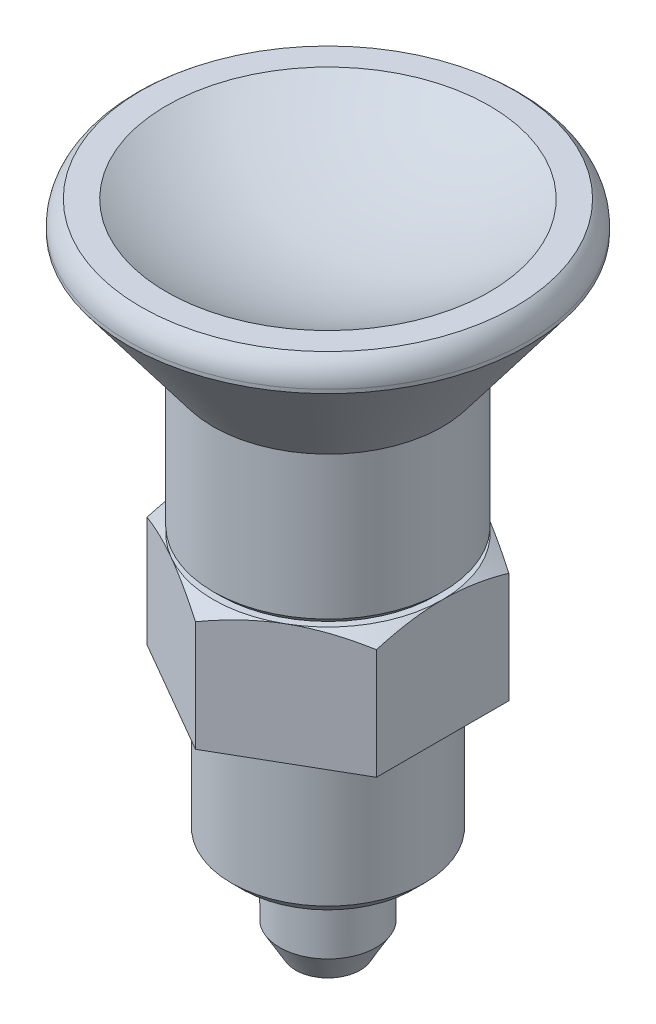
ISO-10303-21;
HEADER;
FILE_DESCRIPTION(('STEP AP214'),'2;1');
FILE_NAME('part.step','',(''),(''),'','','');
FILE_SCHEMA(('AUTOMOTIVE_DESIGN { 1 0 10303 214 1 1 1 1 }'));
ENDSEC;
DATA;
#1=APPLICATION_CONTEXT('core data for automotive mechanical design processes');
#2=APPLICATION_PROTOCOL_DEFINITION('international standard','automotive_design',2000,#1);
#3=PRODUCT_CONTEXT('',#1,'mechanical');
#4=PRODUCT('Part','Part','',(#3));
#5=PRODUCT_RELATED_PRODUCT_CATEGORY('part','',(#4));
#6=PRODUCT_DEFINITION_FORMATION('','',#4);
#7=PRODUCT_DEFINITION_CONTEXT('part definition',#1,'design');
#8=PRODUCT_DEFINITION('design','',#6,#7);
#9=PRODUCT_DEFINITION_SHAPE('','',#8);
#10=(LENGTH_UNIT() NAMED_UNIT(*) SI_UNIT(.MILLI.,.METRE.));
#11=(NAMED_UNIT(*) PLANE_ANGLE_UNIT() SI_UNIT($,.RADIAN.));
#12=(NAMED_UNIT(*) SI_UNIT($,.STERADIAN.) SOLID_ANGLE_UNIT());
#13=UNCERTAINTY_MEASURE_WITH_UNIT(LENGTH_MEASURE(1.E-05),#10,'distance_accuracy_value','');
#14=(GEOMETRIC_REPRESENTATION_CONTEXT(3) GLOBAL_UNCERTAINTY_ASSIGNED_CONTEXT((#13)) GLOBAL_UNIT_ASSIGNED_CONTEXT((#10,
#11,#12)) REPRESENTATION_CONTEXT('',''));
#15=CARTESIAN_POINT('',(0.,0.,0.));
#16=DIRECTION('',(0.,0.,1.));
#17=DIRECTION('',(1.,0.,0.));
#18=AXIS2_PLACEMENT_3D('',#15,#16,#17);
#19=CARTESIAN_POINT('',(2.67209438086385,-30.,0.));
#20=DIRECTION('',(0.,1.,0.));
#21=DIRECTION('',(0.,0.,1.));
#22=AXIS2_PLACEMENT_3D('',#19,#20,#21);
#23=PLANE('',#22);
#24=CARTESIAN_POINT('',(0.,-29.9999999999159,0.));
#25=DIRECTION('',(0.,1.,0.));
#26=DIRECTION('',(-1.,0.,0.));
#27=AXIS2_PLACEMENT_3D('',#24,#25,#26);
#28=CIRCLE('',#27,2.67209438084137);
#29=CARTESIAN_POINT('',(-2.67209438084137,-29.9999999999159,0.));
#30=VERTEX_POINT('',#29);
#31=EDGE_CURVE('E20',#30,#30,#28,.T.);
#32=ORIENTED_EDGE('',*,*,#31,.F.);
#33=EDGE_LOOP('',(#32));
#34=FACE_BOUND('',#33,.T.);
#35=ADVANCED_FACE('F16',(#34),#23,.F.);
#36=CARTESIAN_POINT('',(0.,-27.6999999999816,0.));
#37=DIRECTION('',(0.,1.,0.));
#38=DIRECTION('',(-1.,0.,0.));
#39=AXIS2_PLACEMENT_3D('',#36,#37,#38);
#40=CONICAL_SURFACE('',#39,4.0000000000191,0.523598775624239);
#41=CARTESIAN_POINT('',(0.,-27.7,0.));
#42=DIRECTION('',(0.,1.,0.));
#43=DIRECTION('',(0.,0.,1.));
#44=AXIS2_PLACEMENT_3D('',#41,#42,#43);
#45=CIRCLE('',#44,4.);
#46=CARTESIAN_POINT('',(0.,-27.7,4.));
#47=VERTEX_POINT('',#46);
#48=EDGE_CURVE('E144',#47,#47,#45,.T.);
#49=ORIENTED_EDGE('',*,*,#48,.F.);
#50=EDGE_LOOP('',(#49));
#51=FACE_BOUND('',#50,.T.);
#52=ORIENTED_EDGE('',*,*,#31,.T.);
#53=EDGE_LOOP('',(#52));
#54=FACE_BOUND('',#53,.T.);
#55=ADVANCED_FACE('F486',(#51,#54),#40,.T.);
#56=CARTESIAN_POINT('',(0.,-30.,0.));
#57=DIRECTION('',(0.,1.,0.));
#58=DIRECTION('',(0.,0.,1.));
#59=AXIS2_PLACEMENT_3D('',#56,#57,#58);
#60=CYLINDRICAL_SURFACE('',#59,4.);
#61=ORIENTED_EDGE('',*,*,#48,.T.);
#62=EDGE_LOOP('',(#61));
#63=FACE_BOUND('',#62,.T.);
#64=CARTESIAN_POINT('',(0.,-22.,0.));
#65=DIRECTION('',(0.,1.,0.));
#66=DIRECTION('',(0.,0.,1.));
#67=AXIS2_PLACEMENT_3D('',#64,#65,#66);
#68=CIRCLE('',#67,4.);
#69=CARTESIAN_POINT('',(0.,-22.,4.));
#70=VERTEX_POINT('',#69);
#71=EDGE_CURVE('E142',#70,#70,#68,.T.);
#72=ORIENTED_EDGE('',*,*,#71,.F.);
#73=EDGE_LOOP('',(#72));
#74=FACE_BOUND('',#73,.T.);
#75=ADVANCED_FACE('F476',(#63,#74),#60,.T.);
#76=CARTESIAN_POINT('',(4.,-22.,0.));
#77=DIRECTION('',(0.,-1.,0.));
#78=DIRECTION('',(0.,0.,-1.));
#79=AXIS2_PLACEMENT_3D('',#76,#77,#78);
#80=PLANE('',#79);
#81=CARTESIAN_POINT('',(0.,-22.,0.));
#82=DIRECTION('',(0.,1.,0.));
#83=DIRECTION('',(-1.,0.,0.));
#84=AXIS2_PLACEMENT_3D('',#81,#82,#83);
#85=CIRCLE('',#84,7.08);
#86=CARTESIAN_POINT('',(-7.08,-22.,0.));
#87=VERTEX_POINT('',#86);
#88=EDGE_CURVE('E140',#87,#87,#85,.T.);
#89=ORIENTED_EDGE('',*,*,#88,.F.);
#90=EDGE_LOOP('',(#89));
#91=FACE_BOUND('',#90,.T.);
#92=ORIENTED_EDGE('',*,*,#71,.T.);
#93=EDGE_LOOP('',(#92));
#94=FACE_BOUND('',#93,.T.);
#95=ADVANCED_FACE('F466',(#91,#94),#80,.T.);
#96=CARTESIAN_POINT('',(0.,-21.08,0.));
#97=DIRECTION('',(0.,1.,0.));
#98=DIRECTION('',(-1.,0.,0.));
#99=AXIS2_PLACEMENT_3D('',#96,#97,#98);
#100=CONICAL_SURFACE('',#99,8.,0.785398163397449);
#101=CARTESIAN_POINT('',(0.,-21.08,0.));
#102=DIRECTION('',(0.,1.,0.));
#103=DIRECTION('',(0.,0.,1.));
#104=AXIS2_PLACEMENT_3D('',#101,#102,#103);
#105=CIRCLE('',#104,8.);
#106=CARTESIAN_POINT('',(0.,-21.08,8.));
#107=VERTEX_POINT('',#106);
#108=EDGE_CURVE('E139',#107,#107,#105,.T.);
#109=ORIENTED_EDGE('',*,*,#108,.F.);
#110=EDGE_LOOP('',(#109));
#111=FACE_BOUND('',#110,.T.);
#112=ORIENTED_EDGE('',*,*,#88,.T.);
#113=EDGE_LOOP('',(#112));
#114=FACE_BOUND('',#113,.T.);
#115=ADVANCED_FACE('F456',(#111,#114),#100,.T.);
#116=CARTESIAN_POINT('',(0.,-22.,0.));
#117=DIRECTION('',(0.,1.,0.));
#118=DIRECTION('',(0.,0.,1.));
#119=AXIS2_PLACEMENT_3D('',#116,#117,#118);
#120=CYLINDRICAL_SURFACE('',#119,8.);
#121=ORIENTED_EDGE('',*,*,#108,.T.);
#122=EDGE_LOOP('',(#121));
#123=FACE_BOUND('',#122,.T.);
#124=CARTESIAN_POINT('',(0.,-10.,0.));
#125=DIRECTION('',(0.,1.,0.));
#126=DIRECTION('',(0.,0.,1.));
#127=AXIS2_PLACEMENT_3D('',#124,#125,#126);
#128=CIRCLE('',#127,8.);
#129=CARTESIAN_POINT('',(0.,-10.,8.));
#130=VERTEX_POINT('',#129);
#131=EDGE_CURVE('E135',#130,#130,#128,.T.);
#132=ORIENTED_EDGE('',*,*,#131,.F.);
#133=EDGE_LOOP('',(#132));
#134=FACE_BOUND('',#133,.T.);
#135=ADVANCED_FACE('F447',(#123,#134),#120,.T.);
#136=CARTESIAN_POINT('',(8.,-10.,0.));
#137=DIRECTION('',(0.,-1.,0.));
#138=DIRECTION('',(0.,0.,-1.));
#139=AXIS2_PLACEMENT_3D('',#136,#137,#138);
#140=PLANE('',#139);
#141=DIRECTION('',(0.866025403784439,0.,0.5));
#142=VECTOR('',#141,1.);
#143=CARTESIAN_POINT('',(-9.5,-10.,5.48482755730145));
#144=LINE('',#143,#142);
#145=CARTESIAN_POINT('',(-9.5,-10.,5.48482755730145));
#146=VERTEX_POINT('',#145);
#147=CARTESIAN_POINT('',(-9.61949607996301E-09,-10.,10.9696551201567));
#148=VERTEX_POINT('',#147);
#149=EDGE_CURVE('E138',#146,#148,#144,.T.);
#150=ORIENTED_EDGE('',*,*,#149,.F.);
#151=DIRECTION('',(0.,0.,1.));
#152=VECTOR('',#151,1.);
#153=CARTESIAN_POINT('',(-9.5,-10.,-5.48482755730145));
#154=LINE('',#153,#152);
#155=CARTESIAN_POINT('',(-9.5,-10.,-5.4848275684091));
#156=VERTEX_POINT('',#155);
#157=EDGE_CURVE('E88',#156,#146,#154,.T.);
#158=ORIENTED_EDGE('',*,*,#157,.F.);
#159=DIRECTION('',(-0.866025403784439,0.,0.5));
#160=VECTOR('',#159,1.);
#161=CARTESIAN_POINT('',(0.,-10.,-10.9696551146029));
#162=LINE('',#161,#160);
#163=CARTESIAN_POINT('',(-7.69530202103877E-09,-10.,-10.96965511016));
#164=VERTEX_POINT('',#163);
#165=EDGE_CURVE('E84',#164,#156,#162,.T.);
#166=ORIENTED_EDGE('',*,*,#165,.F.);
#167=DIRECTION('',(-0.866025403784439,0.,-0.5));
#168=VECTOR('',#167,1.);
#169=CARTESIAN_POINT('',(9.5,-10.,-5.48482755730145));
#170=LINE('',#169,#168);
#171=CARTESIAN_POINT('',(9.50000000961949,-10.,-5.48482755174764));
#172=VERTEX_POINT('',#171);
#173=EDGE_CURVE('E259',#172,#164,#170,.T.);
#174=ORIENTED_EDGE('',*,*,#173,.F.);
#175=DIRECTION('',(0.,0.,-1.));
#176=VECTOR('',#175,1.);
#177=CARTESIAN_POINT('',(9.5,-10.,5.48482755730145));
#178=LINE('',#177,#176);
#179=CARTESIAN_POINT('',(9.5,-10.,5.48482756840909));
#180=VERTEX_POINT('',#179);
#181=EDGE_CURVE('E270',#180,#172,#178,.T.);
#182=ORIENTED_EDGE('',*,*,#181,.F.);
#183=DIRECTION('',(0.866025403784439,0.,-0.5));
#184=VECTOR('',#183,1.);
#185=CARTESIAN_POINT('',(0.,-10.,10.9696551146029));
#186=LINE('',#185,#184);
#187=EDGE_CURVE('E274',#148,#180,#186,.T.);
#188=ORIENTED_EDGE('',*,*,#187,.F.);
#189=EDGE_LOOP('',(#150,#158,#166,#174,#182,#188));
#190=FACE_BOUND('',#189,.T.);
#191=ORIENTED_EDGE('',*,*,#131,.T.);
#192=EDGE_LOOP('',(#191));
#193=FACE_BOUND('',#192,.T.);
#194=ADVANCED_FACE('F305',(#190,#193),#140,.T.);
#195=CARTESIAN_POINT('',(-9.5,-12.,5.48482755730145));
#196=DIRECTION('',(-0.5,0.,0.866025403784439));
#197=DIRECTION('',(0.866025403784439,0.,0.5));
#198=AXIS2_PLACEMENT_3D('',#195,#196,#197);
#199=PLANE('',#198);
#200=CARTESIAN_POINT('',(-4.74999999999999,0.,8.22724133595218));
#201=CARTESIAN_POINT('',(-4.54838914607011,3.8826146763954E-05,8.34364141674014));
#202=CARTESIAN_POINT('',(-4.34678800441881,-0.00493960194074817,8.46003589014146));
#203=CARTESIAN_POINT('',(-3.94398156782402,-0.0246423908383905,8.69259629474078));
#204=CARTESIAN_POINT('',(-3.74277620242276,-0.0393648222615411,8.80876226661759));
#205=CARTESIAN_POINT('',(-3.34206094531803,-0.0781700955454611,9.04011532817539));
#206=CARTESIAN_POINT('',(-3.14254760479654,-0.102205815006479,9.1553044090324));
#207=CARTESIAN_POINT('',(-2.74447147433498,-0.159120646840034,9.38513377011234));
#208=CARTESIAN_POINT('',(-2.54590870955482,-0.191999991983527,9.4997740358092));
#209=CARTESIAN_POINT('',(-1.95246933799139,-0.302887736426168,9.84239641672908));
#210=CARTESIAN_POINT('',(-1.55931669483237,-0.393199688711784,10.0693832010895));
#211=CARTESIAN_POINT('',(-0.7763923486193,-0.601482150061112,10.5214047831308));
#212=CARTESIAN_POINT('',(-0.38664795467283,-0.71959079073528,10.7464238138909));
#213=CARTESIAN_POINT('',(2.33076441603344E-08,-0.848505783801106,10.9696551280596));
#214=B_SPLINE_CURVE_WITH_KNOTS('',3,(#200,#201,#202,#203,#204,#205,#206,#207,#208,#209,#210,
#211,#212,#213),.UNSPECIFIED.,.F.,.F.,(4,2,2,2,2,2,4),(0.,0.698329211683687,1.39652019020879,
2.09122371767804,2.78594553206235,4.17356830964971,5.56823796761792),.UNSPECIFIED.);
#215=CARTESIAN_POINT('',(-4.75,0.,8.22724133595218));
#216=VERTEX_POINT('',#215);
#217=CARTESIAN_POINT('',(4.43919894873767E-09,-0.848505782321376,10.9696551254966));
#218=VERTEX_POINT('',#217);
#219=EDGE_CURVE('E198',#216,#218,#214,.T.);
#220=ORIENTED_EDGE('',*,*,#219,.F.);
#221=CARTESIAN_POINT('',(-9.50000003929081,-0.848505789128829,5.48482753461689));
#222=CARTESIAN_POINT('',(-9.11335206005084,-0.719590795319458,5.70805884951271));
#223=CARTESIAN_POINT('',(-8.72360766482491,-0.601482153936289,5.93307788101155));
#224=CARTESIAN_POINT('',(-7.94068331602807,-0.393199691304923,6.38509946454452));
#225=CARTESIAN_POINT('',(-7.54753067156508,-0.30288773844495,6.61208624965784));
#226=CARTESIAN_POINT('',(-6.95409129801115,-0.191999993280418,6.95470863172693));
#227=CARTESIAN_POINT('',(-6.75552853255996,-0.159120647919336,7.0693488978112));
#228=CARTESIAN_POINT('',(-6.35745240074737,-0.102205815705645,7.29917825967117));
#229=CARTESIAN_POINT('',(-6.15793905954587,-0.0781700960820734,7.41436734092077));
#230=CARTESIAN_POINT('',(-5.75722380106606,-0.0393648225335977,7.64572040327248));
#231=CARTESIAN_POINT('',(-5.55601843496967,-0.0246423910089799,7.76188637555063));
#232=CARTESIAN_POINT('',(-5.15321199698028,-0.00493960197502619,7.99444678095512));
#233=CARTESIAN_POINT('',(-4.95161085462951,3.88261472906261E-05,8.11084125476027));
#234=CARTESIAN_POINT('',(-4.75,0.,8.22724133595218));
#235=B_SPLINE_CURVE_WITH_KNOTS('',3,(#221,#222,#223,#224,#225,#226,#227,#228,#229,#230,#231,
#232,#233,#234),.UNSPECIFIED.,.F.,.F.,(4,2,2,2,2,2,4),(0.,1.39466966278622,2.78229244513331,
3.47701426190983,4.17171779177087,4.86990877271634,5.56823798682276),.UNSPECIFIED.);
#236=CARTESIAN_POINT('',(-9.5,-0.848505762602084,5.48482751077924));
#237=VERTEX_POINT('',#236);
#238=EDGE_CURVE('E128',#237,#216,#235,.T.);
#239=ORIENTED_EDGE('',*,*,#238,.F.);
#240=DIRECTION('',(0.,1.,0.));
#241=VECTOR('',#240,1.);
#242=CARTESIAN_POINT('',(-9.5,-12.,5.48482755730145));
#243=LINE('',#242,#241);
#244=EDGE_CURVE('E129',#146,#237,#243,.T.);
#245=ORIENTED_EDGE('',*,*,#244,.F.);
#246=ORIENTED_EDGE('',*,*,#149,.T.);
#247=DIRECTION('',(0.,1.,0.));
#248=VECTOR('',#247,1.);
#249=CARTESIAN_POINT('',(-1.44292474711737E-08,-12.,10.9696551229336));
#250=LINE('',#249,#248);
#251=EDGE_CURVE('E277',#218,#148,#250,.F.);
#252=ORIENTED_EDGE('',*,*,#251,.F.);
#253=EDGE_LOOP('',(#220,#239,#245,#246,#252));
#254=FACE_BOUND('',#253,.T.);
#255=ADVANCED_FACE('F317',(#254),#199,.T.);
#256=CARTESIAN_POINT('',(0.,-12.,10.9696551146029));
#257=DIRECTION('',(0.5,0.,0.866025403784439));
#258=DIRECTION('',(0.866025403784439,0.,-0.5));
#259=AXIS2_PLACEMENT_3D('',#256,#257,#258);
#260=PLANE('',#259);
#261=CARTESIAN_POINT('',(4.75000000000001,0.,8.22724133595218));
#262=CARTESIAN_POINT('',(4.95161085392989,3.8826146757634E-05,8.11084125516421));
#263=CARTESIAN_POINT('',(5.15321199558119,-0.00493960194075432,7.99444678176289));
#264=CARTESIAN_POINT('',(5.55601843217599,-0.0246423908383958,7.76188637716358));
#265=CARTESIAN_POINT('',(5.75722379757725,-0.0393648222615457,7.64572040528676));
#266=CARTESIAN_POINT('',(6.15793905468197,-0.0781700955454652,7.41436734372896));
#267=CARTESIAN_POINT('',(6.35745239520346,-0.102205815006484,7.29917826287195));
#268=CARTESIAN_POINT('',(6.75552852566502,-0.159120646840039,7.06934890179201));
#269=CARTESIAN_POINT('',(6.95409129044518,-0.191999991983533,6.95470863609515));
#270=CARTESIAN_POINT('',(7.54753066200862,-0.302887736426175,6.61208625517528));
#271=CARTESIAN_POINT('',(7.94068330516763,-0.393199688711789,6.38509947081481));
#272=CARTESIAN_POINT('',(8.72360765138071,-0.601482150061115,5.93307788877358));
#273=CARTESIAN_POINT('',(9.11335204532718,-0.719590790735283,5.70805885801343));
#274=CARTESIAN_POINT('',(9.50000002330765,-0.84850578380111,5.48482754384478));
#275=B_SPLINE_CURVE_WITH_KNOTS('',3,(#261,#262,#263,#264,#265,#266,#267,#268,#269,#270,#271,
#272,#273,#274),.UNSPECIFIED.,.F.,.F.,(4,2,2,2,2,2,4),(0.,0.698329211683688,1.39652019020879,
2.09122371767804,2.78594553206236,4.17356830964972,5.56823796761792),.UNSPECIFIED.);
#276=CARTESIAN_POINT('',(4.75,0.,8.22724133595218));
#277=VERTEX_POINT('',#276);
#278=CARTESIAN_POINT('',(9.50000001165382,-0.848505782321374,5.48482755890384));
#279=VERTEX_POINT('',#278);
#280=EDGE_CURVE('E184',#277,#279,#275,.T.);
#281=ORIENTED_EDGE('',*,*,#280,.F.);
#282=CARTESIAN_POINT('',(6.25977670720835E-08,-0.848505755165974,10.9696550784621));
#283=CARTESIAN_POINT('',(0.386648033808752,-0.719590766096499,10.7464237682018));
#284=CARTESIAN_POINT('',(0.776392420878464,-0.601482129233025,10.5214047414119));
#285=CARTESIAN_POINT('',(1.55931675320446,-0.393199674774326,10.0693831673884));
#286=CARTESIAN_POINT('',(1.95246938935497,-0.302887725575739,9.84239638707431));
#287=CARTESIAN_POINT('',(2.54590875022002,-0.191999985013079,9.49977401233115));
#288=CARTESIAN_POINT('',(2.74447151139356,-0.159120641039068,9.38513374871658));
#289=CARTESIAN_POINT('',(3.14254763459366,-0.102205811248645,9.15530439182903));
#290=CARTESIAN_POINT('',(3.34206097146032,-0.0781700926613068,9.04011531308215));
#291=CARTESIAN_POINT('',(3.74277622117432,-0.0393648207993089,8.80876225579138));
#292=CARTESIAN_POINT('',(3.94398158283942,-0.0246423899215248,8.69259628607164));
#293=CARTESIAN_POINT('',(4.34678801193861,-0.00493960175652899,8.46003588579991));
#294=CARTESIAN_POINT('',(4.54838914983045,3.88261439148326E-05,8.34364141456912));
#295=CARTESIAN_POINT('',(4.75000000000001,0.,8.22724133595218));
#296=B_SPLINE_CURVE_WITH_KNOTS('',3,(#282,#283,#284,#285,#286,#287,#288,#289,#290,#291,#292,
#293,#294,#295),.UNSPECIFIED.,.F.,.F.,(4,2,2,2,2,2,4),(0.,1.39466963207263,2.7822923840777,
3.47701418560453,4.17171770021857,4.8699086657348,5.56823786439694),.UNSPECIFIED.);
#297=EDGE_CURVE('E187',#218,#277,#296,.T.);
#298=ORIENTED_EDGE('',*,*,#297,.F.);
#299=ORIENTED_EDGE('',*,*,#251,.T.);
#300=ORIENTED_EDGE('',*,*,#187,.T.);
#301=DIRECTION('',(0.,1.,0.));
#302=VECTOR('',#301,1.);
#303=CARTESIAN_POINT('',(9.5,-12.,5.4848275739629));
#304=LINE('',#303,#302);
#305=EDGE_CURVE('E190',#279,#180,#304,.F.);
#306=ORIENTED_EDGE('',*,*,#305,.F.);
#307=EDGE_LOOP('',(#281,#298,#299,#300,#306));
#308=FACE_BOUND('',#307,.T.);
#309=ADVANCED_FACE('F185',(#308),#260,.T.);
#310=CARTESIAN_POINT('',(9.5,-12.,5.48482755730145));
#311=DIRECTION('',(1.,0.,0.));
#312=DIRECTION('',(0.,0.,-1.));
#313=AXIS2_PLACEMENT_3D('',#310,#311,#312);
#314=PLANE('',#313);
#315=CARTESIAN_POINT('',(9.5,0.,0.));
#316=CARTESIAN_POINT('',(9.5,3.88261467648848E-05,-0.232800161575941));
#317=CARTESIAN_POINT('',(9.5,-0.00493960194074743,-0.465589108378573));
#318=CARTESIAN_POINT('',(9.5,-0.0246423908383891,-0.930709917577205));
#319=CARTESIAN_POINT('',(9.5,-0.0393648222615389,-1.16304186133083));
#320=CARTESIAN_POINT('',(9.5,-0.0781700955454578,-1.62574798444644));
#321=CARTESIAN_POINT('',(9.5,-0.102205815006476,-1.85612614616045));
#322=CARTESIAN_POINT('',(9.5,-0.159120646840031,-2.31578486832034));
#323=CARTESIAN_POINT('',(9.5,-0.191999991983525,-2.54506539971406));
#324=CARTESIAN_POINT('',(9.5,-0.302887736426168,-3.23031016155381));
#325=CARTESIAN_POINT('',(9.5,-0.393199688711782,-3.68428373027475));
#326=CARTESIAN_POINT('',(9.5,-0.601482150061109,-4.58832689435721));
#327=CARTESIAN_POINT('',(9.5,-0.719590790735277,-5.0383649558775));
#328=CARTESIAN_POINT('',(9.5,-0.848505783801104,-5.4848275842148));
#329=B_SPLINE_CURVE_WITH_KNOTS('',3,(#315,#316,#317,#318,#319,#320,#321,#322,#323,#324,#325,
#326,#327,#328),.UNSPECIFIED.,.F.,.F.,(4,2,2,2,2,2,4),(0.,0.698329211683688,1.39652019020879,
2.09122371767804,2.78594553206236,4.17356830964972,5.56823796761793),.UNSPECIFIED.);
#330=CARTESIAN_POINT('',(9.5,0.,0.));
#331=VERTEX_POINT('',#330);
#332=CARTESIAN_POINT('',(9.50000000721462,-0.84850578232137,-5.48482756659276));
#333=VERTEX_POINT('',#332);
#334=EDGE_CURVE('E224',#331,#333,#329,.T.);
#335=ORIENTED_EDGE('',*,*,#334,.F.);
#336=CARTESIAN_POINT('',(9.5,-0.848505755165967,5.48482748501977));
#337=CARTESIAN_POINT('',(9.5,-0.719590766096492,5.0383648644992));
#338=CARTESIAN_POINT('',(9.5,-0.601482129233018,4.58832681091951));
#339=CARTESIAN_POINT('',(9.5,-0.393199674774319,3.68428366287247));
#340=CARTESIAN_POINT('',(9.5,-0.302887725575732,3.23031010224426));
#341=CARTESIAN_POINT('',(9.5,-0.191999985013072,2.54506535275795));
#342=CARTESIAN_POINT('',(9.5,-0.159120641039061,2.31578482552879));
#343=CARTESIAN_POINT('',(9.5,-0.102205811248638,1.85612611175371));
#344=CARTESIAN_POINT('',(9.5,-0.0781700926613,1.62574795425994));
#345=CARTESIAN_POINT('',(9.5,-0.0393648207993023,1.1630418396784));
#346=CARTESIAN_POINT('',(9.5,-0.024642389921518,0.930709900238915));
#347=CARTESIAN_POINT('',(9.5,-0.00493960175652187,0.465589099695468));
#348=CARTESIAN_POINT('',(9.5,3.88261439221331E-05,0.232800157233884));
#349=CARTESIAN_POINT('',(9.5,0.,0.));
#350=B_SPLINE_CURVE_WITH_KNOTS('',3,(#336,#337,#338,#339,#340,#341,#342,#343,#344,#345,#346,
#347,#348,#349),.UNSPECIFIED.,.F.,.F.,(4,2,2,2,2,2,4),(0.,1.39466963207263,2.7822923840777,
3.47701418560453,4.17171770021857,4.86990866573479,5.56823786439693),.UNSPECIFIED.);
#351=EDGE_CURVE('E194',#279,#331,#350,.T.);
#352=ORIENTED_EDGE('',*,*,#351,.F.);
#353=ORIENTED_EDGE('',*,*,#305,.T.);
#354=ORIENTED_EDGE('',*,*,#181,.T.);
#355=DIRECTION('',(0.,1.,0.));
#356=VECTOR('',#355,1.);
#357=CARTESIAN_POINT('',(9.50000001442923,-12.,-5.48482754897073));
#358=LINE('',#357,#356);
#359=EDGE_CURVE('E262',#333,#172,#358,.F.);
#360=ORIENTED_EDGE('',*,*,#359,.F.);
#361=EDGE_LOOP('',(#335,#352,#353,#354,#360));
#362=FACE_BOUND('',#361,.T.);
#363=ADVANCED_FACE('F216',(#362),#314,.T.);
#364=CARTESIAN_POINT('',(9.5,-12.,-5.48482755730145));
#365=DIRECTION('',(0.5,0.,-0.866025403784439));
#366=DIRECTION('',(-0.866025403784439,0.,-0.5));
#367=AXIS2_PLACEMENT_3D('',#364,#365,#366);
#368=PLANE('',#367);
#369=CARTESIAN_POINT('',(4.75,0.,-8.22724133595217));
#370=CARTESIAN_POINT('',(4.54838915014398,3.88261436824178E-05,-8.34364141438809));
#371=CARTESIAN_POINT('',(4.34678801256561,-0.00493960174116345,-8.4600358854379));
#372=CARTESIAN_POINT('',(3.94398158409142,-0.0246423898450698,-8.69259628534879));
#373=CARTESIAN_POINT('',(3.74277622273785,-0.0393648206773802,-8.80876225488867));
#374=CARTESIAN_POINT('',(3.34206097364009,-0.0781700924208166,-9.04011531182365));
#375=CARTESIAN_POINT('',(3.14254763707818,-0.102205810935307,-9.15530439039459));
#376=CARTESIAN_POINT('',(2.74447151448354,-0.159120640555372,-9.38513374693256));
#377=CARTESIAN_POINT('',(2.54590875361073,-0.191999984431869,-9.49977401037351));
#378=CARTESIAN_POINT('',(1.95246939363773,-0.30288772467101,-9.84239638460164));
#379=CARTESIAN_POINT('',(1.5593167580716,-0.393199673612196,-10.0693831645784));
#380=CARTESIAN_POINT('',(0.776392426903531,-0.601482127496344,-10.5214047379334));
#381=CARTESIAN_POINT('',(0.386648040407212,-0.719590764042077,-10.7464237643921));
#382=CARTESIAN_POINT('',(6.97606773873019E-08,-0.848505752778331,-10.9696550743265));
#383=B_SPLINE_CURVE_WITH_KNOTS('',3,(#369,#370,#371,#372,#373,#374,#375,#376,#377,#378,#379,
#380,#381,#382),.UNSPECIFIED.,.F.,.F.,(4,2,2,2,2,2,4),(0.,0.698329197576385,1.39652016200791,
2.09122367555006,2.78594547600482,4.1735682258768,5.56823785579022),.UNSPECIFIED.);
#384=CARTESIAN_POINT('',(4.75,0.,-8.22724133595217));
#385=VERTEX_POINT('',#384);
#386=CARTESIAN_POINT('',(-5.77147470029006E-09,-0.848505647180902,-10.9696548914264));
#387=VERTEX_POINT('',#386);
#388=EDGE_CURVE('E230',#385,#387,#383,.T.);
#389=ORIENTED_EDGE('',*,*,#388,.F.);
#390=CARTESIAN_POINT('',(9.49999993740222,-0.848505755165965,-5.48482759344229));
#391=CARTESIAN_POINT('',(9.11335196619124,-0.719590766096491,-5.70805890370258));
#392=CARTESIAN_POINT('',(8.72360757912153,-0.601482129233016,-5.93307793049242));
#393=CARTESIAN_POINT('',(7.94068324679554,-0.393199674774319,-6.38509950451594));
#394=CARTESIAN_POINT('',(7.54753061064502,-0.302887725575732,-6.61208628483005));
#395=CARTESIAN_POINT('',(6.95409124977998,-0.191999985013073,-6.9547086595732));
#396=CARTESIAN_POINT('',(6.75552848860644,-0.159120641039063,-7.06934892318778));
#397=CARTESIAN_POINT('',(6.35745236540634,-0.102205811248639,-7.29917828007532));
#398=CARTESIAN_POINT('',(6.15793902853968,-0.0781700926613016,-7.41436735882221));
#399=CARTESIAN_POINT('',(5.75722377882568,-0.039364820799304,-7.64572041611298));
#400=CARTESIAN_POINT('',(5.55601841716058,-0.0246423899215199,-7.76188638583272));
#401=CARTESIAN_POINT('',(5.1532119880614,-0.00493960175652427,-7.99444678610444));
#402=CARTESIAN_POINT('',(4.95161085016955,3.88261439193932E-05,-8.11084125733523));
#403=CARTESIAN_POINT('',(4.75,0.,-8.22724133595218));
#404=B_SPLINE_CURVE_WITH_KNOTS('',3,(#390,#391,#392,#393,#394,#395,#396,#397,#398,#399,#400,
#401,#402,#403),.UNSPECIFIED.,.F.,.F.,(4,2,2,2,2,2,4),(0.,1.39466963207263,2.78229238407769,
3.47701418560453,4.17171770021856,4.86990866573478,5.56823786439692),.UNSPECIFIED.);
#405=EDGE_CURVE('E193',#333,#385,#404,.T.);
#406=ORIENTED_EDGE('',*,*,#405,.F.);
#407=ORIENTED_EDGE('',*,*,#359,.T.);
#408=ORIENTED_EDGE('',*,*,#173,.T.);
#409=DIRECTION('',(0.,1.,0.));
#410=VECTOR('',#409,1.);
#411=CARTESIAN_POINT('',(-1.15429494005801E-08,-12.,-10.9696551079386));
#412=LINE('',#411,#410);
#413=EDGE_CURVE('E255',#387,#164,#412,.F.);
#414=ORIENTED_EDGE('',*,*,#413,.F.);
#415=EDGE_LOOP('',(#389,#406,#407,#408,#414));
#416=FACE_BOUND('',#415,.T.);
#417=ADVANCED_FACE('F219',(#416),#368,.T.);
#418=CARTESIAN_POINT('',(0.,-12.,-10.9696551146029));
#419=DIRECTION('',(-0.5,0.,-0.866025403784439));
#420=DIRECTION('',(-0.866025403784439,0.,0.5));
#421=AXIS2_PLACEMENT_3D('',#418,#419,#420);
#422=PLANE('',#421);
#423=CARTESIAN_POINT('',(-4.75,0.,-8.22724133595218));
#424=CARTESIAN_POINT('',(-4.95161084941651,3.88261433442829E-05,-8.11084125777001));
#425=CARTESIAN_POINT('',(-5.15321198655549,-0.00493960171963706,-7.99444678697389));
#426=CARTESIAN_POINT('',(-5.5560184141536,-0.0246423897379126,-7.76188638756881));
#427=CARTESIAN_POINT('',(-5.75722377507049,-0.0393648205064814,-7.64572041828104));
#428=CARTESIAN_POINT('',(-6.15793902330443,-0.0781700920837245,-7.41436736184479));
#429=CARTESIAN_POINT('',(-6.35745235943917,-0.102205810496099,-7.29917828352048));
#430=CARTESIAN_POINT('',(-6.75552848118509,-0.159120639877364,-7.06934892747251));
#431=CARTESIAN_POINT('',(-6.95409124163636,-0.191999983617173,-6.95470866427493));
#432=CARTESIAN_POINT('',(-7.54753060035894,-0.302887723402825,-6.61208629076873));
#433=CARTESIAN_POINT('',(-7.94068323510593,-0.393199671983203,-6.38509951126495));
#434=CARTESIAN_POINT('',(-8.72360756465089,-0.60148212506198,-5.93307793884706));
#435=CARTESIAN_POINT('',(-9.11335195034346,-0.719590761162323,-5.70805891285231));
#436=CARTESIAN_POINT('',(-9.49999992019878,-0.848505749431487,-5.48482760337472));
#437=B_SPLINE_CURVE_WITH_KNOTS('',3,(#423,#424,#425,#426,#427,#428,#429,#430,#431,#432,#433,
#434,#435,#436),.UNSPECIFIED.,.F.,.F.,(4,2,2,2,2,2,4),(0.,0.69832919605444,1.3965201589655,
2.09122367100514,2.78594546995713,4.17356821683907,5.56823784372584),.UNSPECIFIED.);
#438=CARTESIAN_POINT('',(-4.75,0.,-8.22724133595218));
#439=VERTEX_POINT('',#438);
#440=CARTESIAN_POINT('',(-9.49999995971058,-0.848505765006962,-5.4848275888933));
#441=VERTEX_POINT('',#440);
#442=EDGE_CURVE('E70',#439,#441,#437,.T.);
#443=ORIENTED_EDGE('',*,*,#442,.F.);
#444=CARTESIAN_POINT('',(-5.05430023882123E-08,-0.848505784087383,-10.9696550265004));
#445=CARTESIAN_POINT('',(-0.386648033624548,-0.719590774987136,-10.7464237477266));
#446=CARTESIAN_POINT('',(-0.776392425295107,-0.60148213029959,-10.5214047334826));
#447=CARTESIAN_POINT('',(-1.55931676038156,-0.393199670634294,-10.069383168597));
#448=CARTESIAN_POINT('',(-1.95246939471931,-0.302887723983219,-9.84239638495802));
#449=CARTESIAN_POINT('',(-2.54590875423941,-0.191999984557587,-9.4997740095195));
#450=CARTESIAN_POINT('',(-2.74447151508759,-0.159120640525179,-9.3851337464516));
#451=CARTESIAN_POINT('',(-3.14254763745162,-0.102205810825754,-9.15530439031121));
#452=CARTESIAN_POINT('',(-3.34206097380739,-0.0781700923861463,-9.04011531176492));
#453=CARTESIAN_POINT('',(-3.7427762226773,-0.0393648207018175,-8.80876225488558));
#454=CARTESIAN_POINT('',(-3.94398158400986,-0.0246423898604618,-8.69259628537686));
#455=CARTESIAN_POINT('',(-4.34678801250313,-0.00493960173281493,-8.46003588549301));
#456=CARTESIAN_POINT('',(-4.54838915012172,3.88261637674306E-05,-8.34364141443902));
#457=CARTESIAN_POINT('',(-4.75,0.,-8.22724133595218));
#458=B_SPLINE_CURVE_WITH_KNOTS('',3,(#444,#445,#446,#447,#448,#449,#450,#451,#452,#453,#454,
#455,#456,#457),.UNSPECIFIED.,.F.,.F.,(4,2,2,2,2,2,4),(0.,1.39466963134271,2.78229238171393,
3.47701418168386,4.17171769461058,4.86990865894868,5.56823785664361),.UNSPECIFIED.);
#459=EDGE_CURVE('E35',#387,#439,#458,.T.);
#460=ORIENTED_EDGE('',*,*,#459,.F.);
#461=ORIENTED_EDGE('',*,*,#413,.T.);
#462=ORIENTED_EDGE('',*,*,#165,.T.);
#463=DIRECTION('',(0.,1.,0.));
#464=VECTOR('',#463,1.);
#465=CARTESIAN_POINT('',(-9.5,-12.,-5.48482757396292));
#466=LINE('',#465,#464);
#467=EDGE_CURVE('E79',#441,#156,#466,.F.);
#468=ORIENTED_EDGE('',*,*,#467,.F.);
#469=EDGE_LOOP('',(#443,#460,#461,#462,#468));
#470=FACE_BOUND('',#469,.T.);
#471=ADVANCED_FACE('F80',(#470),#422,.T.);
#472=CARTESIAN_POINT('',(-9.5,-12.,-5.48482755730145));
#473=DIRECTION('',(-1.,0.,0.));
#474=DIRECTION('',(0.,0.,1.));
#475=AXIS2_PLACEMENT_3D('',#472,#473,#474);
#476=PLANE('',#475);
#477=CARTESIAN_POINT('',(-9.5,0.,0.));
#478=CARTESIAN_POINT('',(-9.5,3.88261433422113E-05,0.232800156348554));
#479=CARTESIAN_POINT('',(-9.5,-0.00493960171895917,0.465589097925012));
#480=CARTESIAN_POINT('',(-9.5,-0.024642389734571,0.930709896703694));
#481=CARTESIAN_POINT('',(-9.5,-0.0393648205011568,1.16304183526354));
#482=CARTESIAN_POINT('',(-9.5,-0.078170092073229,1.625747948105));
#483=CARTESIAN_POINT('',(-9.5,-0.102205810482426,1.85612610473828));
#484=CARTESIAN_POINT('',(-9.5,-0.159120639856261,2.31578481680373));
#485=CARTESIAN_POINT('',(-9.5,-0.191999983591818,2.54506534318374));
#486=CARTESIAN_POINT('',(-9.5,-0.302887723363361,3.23031009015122));
#487=CARTESIAN_POINT('',(-9.5,-0.393199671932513,3.68428364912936));
#488=CARTESIAN_POINT('',(-9.5,-0.601482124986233,4.58832679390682));
#489=CARTESIAN_POINT('',(-9.5,-0.719590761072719,5.03836484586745));
#490=CARTESIAN_POINT('',(-9.5,-0.84850574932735,5.48482746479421));
#491=B_SPLINE_CURVE_WITH_KNOTS('',3,(#477,#478,#479,#480,#481,#482,#483,#484,#485,#486,#487,
#488,#489,#490),.UNSPECIFIED.,.F.,.F.,(4,2,2,2,2,2,4),(0.,0.698329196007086,1.39652015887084,
2.09122367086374,2.78594546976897,4.17356821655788,5.56823784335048),.UNSPECIFIED.);
#492=CARTESIAN_POINT('',(-9.5,0.,0.));
#493=VERTEX_POINT('',#492);
#494=EDGE_CURVE('E93',#493,#237,#491,.T.);
#495=ORIENTED_EDGE('',*,*,#494,.F.);
#496=CARTESIAN_POINT('',(-9.5,-0.848505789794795,-5.48482760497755));
#497=CARTESIAN_POINT('',(-9.5,-0.719590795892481,-5.03836497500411));
#498=CARTESIAN_POINT('',(-9.5,-0.601482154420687,-4.58832691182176));
#499=CARTESIAN_POINT('',(-9.5,-0.393199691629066,-3.68428374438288));
#500=CARTESIAN_POINT('',(-9.5,-0.302887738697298,-3.23031017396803));
#501=CARTESIAN_POINT('',(-9.5,-0.191999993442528,-2.54506540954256));
#502=CARTESIAN_POINT('',(-9.5,-0.159120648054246,-2.31578487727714));
#503=CARTESIAN_POINT('',(-9.5,-0.102205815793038,-1.85612615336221));
#504=CARTESIAN_POINT('',(-9.5,-0.0781700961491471,-1.62574799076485));
#505=CARTESIAN_POINT('',(-9.5,-0.0393648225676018,-1.16304186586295));
#506=CARTESIAN_POINT('',(-9.5,-0.0246423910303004,-0.930709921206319));
#507=CARTESIAN_POINT('',(-9.5,-0.00493960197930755,-0.465589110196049));
#508=CARTESIAN_POINT('',(-9.5,3.88261473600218E-05,-0.232800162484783));
#509=CARTESIAN_POINT('',(-9.5,0.,0.));
#510=B_SPLINE_CURVE_WITH_KNOTS('',3,(#496,#497,#498,#499,#500,#501,#502,#503,#504,#505,#506,
#507,#508,#509),.UNSPECIFIED.,.F.,.F.,(4,2,2,2,2,2,4),(0.,1.39466966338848,2.78229244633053,
3.47701426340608,4.17171779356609,4.86990877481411,5.56823798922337),.UNSPECIFIED.);
#511=EDGE_CURVE('E67',#441,#493,#510,.T.);
#512=ORIENTED_EDGE('',*,*,#511,.F.);
#513=ORIENTED_EDGE('',*,*,#467,.T.);
#514=ORIENTED_EDGE('',*,*,#157,.T.);
#515=ORIENTED_EDGE('',*,*,#244,.T.);
#516=EDGE_LOOP('',(#495,#512,#513,#514,#515));
#517=FACE_BOUND('',#516,.T.);
#518=ADVANCED_FACE('F90',(#517),#476,.T.);
#519=CARTESIAN_POINT('',(0.,-0.853596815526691,0.));
#520=DIRECTION('',(0.,-1.,0.));
#521=DIRECTION('',(0.,0.,-1.));
#522=AXIS2_PLACEMENT_3D('',#519,#520,#521);
#523=CONICAL_SURFACE('',#522,10.9784730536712,1.0471975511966);
#524=ORIENTED_EDGE('',*,*,#238,.T.);
#525=CARTESIAN_POINT('',(0.,0.,0.));
#526=DIRECTION('',(0.,-1.,0.));
#527=DIRECTION('',(0.,0.,-1.));
#528=AXIS2_PLACEMENT_3D('',#525,#526,#527);
#529=CIRCLE('',#528,9.5);
#530=EDGE_CURVE('E94',#493,#216,#529,.F.);
#531=ORIENTED_EDGE('',*,*,#530,.F.);
#532=ORIENTED_EDGE('',*,*,#494,.T.);
#533=EDGE_LOOP('',(#524,#531,#532));
#534=FACE_BOUND('',#533,.T.);
#535=ADVANCED_FACE('F116',(#534),#523,.T.);
#536=CARTESIAN_POINT('',(0.,-0.853596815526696,0.));
#537=DIRECTION('',(0.,-1.,0.));
#538=DIRECTION('',(0.,0.,-1.));
#539=AXIS2_PLACEMENT_3D('',#536,#537,#538);
#540=CONICAL_SURFACE('',#539,10.9784730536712,1.0471975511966);
#541=CARTESIAN_POINT('',(0.,0.,0.));
#542=DIRECTION('',(0.,-1.,0.));
#543=DIRECTION('',(0.,0.,-1.));
#544=AXIS2_PLACEMENT_3D('',#541,#542,#543);
#545=CIRCLE('',#544,9.50000000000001);
#546=EDGE_CURVE('E97',#216,#277,#545,.F.);
#547=ORIENTED_EDGE('',*,*,#546,.F.);
#548=ORIENTED_EDGE('',*,*,#219,.T.);
#549=ORIENTED_EDGE('',*,*,#297,.T.);
#550=EDGE_LOOP('',(#547,#548,#549));
#551=FACE_BOUND('',#550,.T.);
#552=ADVANCED_FACE('F321',(#551),#540,.T.);
#553=CARTESIAN_POINT('',(0.,-0.853596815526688,0.));
#554=DIRECTION('',(0.,-1.,0.));
#555=DIRECTION('',(0.,0.,-1.));
#556=AXIS2_PLACEMENT_3D('',#553,#554,#555);
#557=CONICAL_SURFACE('',#556,10.9784730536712,1.0471975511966);
#558=CARTESIAN_POINT('',(0.,0.,0.));
#559=DIRECTION('',(0.,-1.,0.));
#560=DIRECTION('',(0.,0.,-1.));
#561=AXIS2_PLACEMENT_3D('',#558,#559,#560);
#562=CIRCLE('',#561,9.5);
#563=EDGE_CURVE('E168',#277,#331,#562,.F.);
#564=ORIENTED_EDGE('',*,*,#563,.F.);
#565=ORIENTED_EDGE('',*,*,#280,.T.);
#566=ORIENTED_EDGE('',*,*,#351,.T.);
#567=EDGE_LOOP('',(#564,#565,#566));
#568=FACE_BOUND('',#567,.T.);
#569=ADVANCED_FACE('F196',(#568),#557,.T.);
#570=CARTESIAN_POINT('',(0.,-0.853596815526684,0.));
#571=DIRECTION('',(0.,-1.,0.));
#572=DIRECTION('',(0.,0.,-1.));
#573=AXIS2_PLACEMENT_3D('',#570,#571,#572);
#574=CONICAL_SURFACE('',#573,10.9784730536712,1.0471975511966);
#575=CARTESIAN_POINT('',(0.,0.,0.));
#576=DIRECTION('',(0.,-1.,0.));
#577=DIRECTION('',(0.,0.,-1.));
#578=AXIS2_PLACEMENT_3D('',#575,#576,#577);
#579=CIRCLE('',#578,9.5);
#580=EDGE_CURVE('E165',#331,#385,#579,.F.);
#581=ORIENTED_EDGE('',*,*,#580,.F.);
#582=ORIENTED_EDGE('',*,*,#334,.T.);
#583=ORIENTED_EDGE('',*,*,#405,.T.);
#584=EDGE_LOOP('',(#581,#582,#583));
#585=FACE_BOUND('',#584,.T.);
#586=ADVANCED_FACE('F237',(#585),#574,.T.);
#587=CARTESIAN_POINT('',(0.,-0.85359672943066,0.));
#588=DIRECTION('',(0.,-1.,0.));
#589=DIRECTION('',(1.,0.,0.));
#590=AXIS2_PLACEMENT_3D('',#587,#588,#589);
#591=CONICAL_SURFACE('',#590,10.9784729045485,1.0471975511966);
#592=CARTESIAN_POINT('',(0.,0.,0.));
#593=DIRECTION('',(0.,-1.,0.));
#594=DIRECTION('',(1.,0.,0.));
#595=AXIS2_PLACEMENT_3D('',#592,#593,#594);
#596=CIRCLE('',#595,9.5);
#597=EDGE_CURVE('E163',#385,#439,#596,.F.);
#598=ORIENTED_EDGE('',*,*,#597,.F.);
#599=ORIENTED_EDGE('',*,*,#388,.T.);
#600=ORIENTED_EDGE('',*,*,#459,.T.);
#601=EDGE_LOOP('',(#598,#599,#600));
#602=FACE_BOUND('',#601,.T.);
#603=ADVANCED_FACE('F240',(#602),#591,.T.);
#604=CARTESIAN_POINT('',(0.,-0.853596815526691,0.));
#605=DIRECTION('',(0.,-1.,0.));
#606=DIRECTION('',(0.,0.,-1.));
#607=AXIS2_PLACEMENT_3D('',#604,#605,#606);
#608=CONICAL_SURFACE('',#607,10.9784730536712,1.0471975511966);
#609=ORIENTED_EDGE('',*,*,#511,.T.);
#610=CARTESIAN_POINT('',(0.,0.,0.));
#611=DIRECTION('',(0.,-1.,0.));
#612=DIRECTION('',(0.,0.,-1.));
#613=AXIS2_PLACEMENT_3D('',#610,#611,#612);
#614=CIRCLE('',#613,9.5);
#615=EDGE_CURVE('E74',#439,#493,#614,.F.);
#616=ORIENTED_EDGE('',*,*,#615,.F.);
#617=ORIENTED_EDGE('',*,*,#442,.T.);
#618=EDGE_LOOP('',(#609,#616,#617));
#619=FACE_BOUND('',#618,.T.);
#620=ADVANCED_FACE('F72',(#619),#608,.T.);
#621=CARTESIAN_POINT('',(9.5,0.,0.));
#622=DIRECTION('',(0.,1.,0.));
#623=DIRECTION('',(0.,0.,1.));
#624=AXIS2_PLACEMENT_3D('',#621,#622,#623);
#625=PLANE('',#624);
#626=CARTESIAN_POINT('',(0.,0.,0.));
#627=DIRECTION('',(0.,1.,0.));
#628=DIRECTION('',(0.,0.,1.));
#629=AXIS2_PLACEMENT_3D('',#626,#627,#628);
#630=CIRCLE('',#629,8.93431457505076);
#631=CARTESIAN_POINT('',(0.,0.,8.93431457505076));
#632=VERTEX_POINT('',#631);
#633=EDGE_CURVE('E158',#632,#632,#630,.T.);
#634=ORIENTED_EDGE('',*,*,#633,.F.);
#635=EDGE_LOOP('',(#634));
#636=FACE_BOUND('',#635,.T.);
#637=ORIENTED_EDGE('',*,*,#597,.T.);
#638=ORIENTED_EDGE('',*,*,#615,.T.);
#639=ORIENTED_EDGE('',*,*,#530,.T.);
#640=ORIENTED_EDGE('',*,*,#546,.T.);
#641=ORIENTED_EDGE('',*,*,#563,.T.);
#642=ORIENTED_EDGE('',*,*,#580,.T.);
#643=EDGE_LOOP('',(#637,#638,#639,#640,#641,#642));
#644=FACE_BOUND('',#643,.T.);
#645=ADVANCED_FACE('F174',(#636,#644),#625,.T.);
#646=CARTESIAN_POINT('',(0.,0.565685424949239,0.));
#647=DIRECTION('',(0.,1.,0.));
#648=DIRECTION('',(0.,0.,1.));
#649=AXIS2_PLACEMENT_3D('',#646,#647,#648);
#650=CONICAL_SURFACE('',#649,9.5,0.785398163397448);
#651=CARTESIAN_POINT('',(0.,0.565685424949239,0.));
#652=DIRECTION('',(0.,1.,0.));
#653=DIRECTION('',(0.,0.,1.));
#654=AXIS2_PLACEMENT_3D('',#651,#652,#653);
#655=CIRCLE('',#654,9.5);
#656=CARTESIAN_POINT('',(0.,0.565685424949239,9.5));
#657=VERTEX_POINT('',#656);
#658=EDGE_CURVE('E161',#657,#657,#655,.T.);
#659=ORIENTED_EDGE('',*,*,#658,.F.);
#660=EDGE_LOOP('',(#659));
#661=FACE_BOUND('',#660,.T.);
#662=ORIENTED_EDGE('',*,*,#633,.T.);
#663=EDGE_LOOP('',(#662));
#664=FACE_BOUND('',#663,.T.);
#665=ADVANCED_FACE('F358',(#661,#664),#650,.T.);
#666=CARTESIAN_POINT('',(0.,-30.,0.));
#667=DIRECTION('',(0.,1.,0.));
#668=DIRECTION('',(0.,0.,1.));
#669=AXIS2_PLACEMENT_3D('',#666,#667,#668);
#670=CYLINDRICAL_SURFACE('',#669,9.5);
#671=CARTESIAN_POINT('',(0.,12.4,0.));
#672=DIRECTION('',(0.,1.,0.));
#673=DIRECTION('',(0.,0.,1.));
#674=AXIS2_PLACEMENT_3D('',#671,#672,#673);
#675=CIRCLE('',#674,9.49999999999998);
#676=CARTESIAN_POINT('',(0.,12.4,9.49999999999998));
#677=VERTEX_POINT('',#676);
#678=EDGE_CURVE('E577',#677,#677,#675,.T.);
#679=ORIENTED_EDGE('',*,*,#678,.F.);
#680=EDGE_LOOP('',(#679));
#681=FACE_BOUND('',#680,.T.);
#682=ORIENTED_EDGE('',*,*,#658,.T.);
#683=EDGE_LOOP('',(#682));
#684=FACE_BOUND('',#683,.T.);
#685=ADVANCED_FACE('F354',(#681,#684),#670,.T.);
#686=CARTESIAN_POINT('',(0.,21.6893137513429,0.));
#687=DIRECTION('',(0.,1.,0.));
#688=DIRECTION('',(0.,0.,1.));
#689=AXIS2_PLACEMENT_3D('',#686,#687,#688);
#690=CONICAL_SURFACE('',#689,16.5,0.645771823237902);
#691=CARTESIAN_POINT('',(0.,21.6893137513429,0.));
#692=DIRECTION('',(0.,1.,0.));
#693=DIRECTION('',(0.,0.,1.));
#694=AXIS2_PLACEMENT_3D('',#691,#692,#693);
#695=CIRCLE('',#694,16.5);
#696=CARTESIAN_POINT('',(0.,21.6893137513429,16.5));
#697=VERTEX_POINT('',#696);
#698=EDGE_CURVE('E580',#697,#697,#695,.T.);
#699=ORIENTED_EDGE('',*,*,#698,.F.);
#700=EDGE_LOOP('',(#699));
#701=FACE_BOUND('',#700,.T.);
#702=ORIENTED_EDGE('',*,*,#678,.T.);
#703=EDGE_LOOP('',(#702));
#704=FACE_BOUND('',#703,.T.);
#705=ADVANCED_FACE('F350',(#701,#704),#690,.T.);
#706=CARTESIAN_POINT('',(0.,-30.,0.));
#707=DIRECTION('',(0.,1.,0.));
#708=DIRECTION('',(0.,0.,1.));
#709=AXIS2_PLACEMENT_3D('',#706,#707,#708);
#710=CYLINDRICAL_SURFACE('',#709,16.5);
#711=CARTESIAN_POINT('',(0.,22.,0.));
#712=DIRECTION('',(0.,1.,0.));
#713=DIRECTION('',(-1.,0.,0.));
#714=AXIS2_PLACEMENT_3D('',#711,#712,#713);
#715=CIRCLE('',#714,16.5);
#716=CARTESIAN_POINT('',(-16.5,22.,0.));
#717=VERTEX_POINT('',#716);
#718=EDGE_CURVE('E157',#717,#717,#715,.T.);
#719=ORIENTED_EDGE('',*,*,#718,.F.);
#720=EDGE_LOOP('',(#719));
#721=FACE_BOUND('',#720,.T.);
#722=ORIENTED_EDGE('',*,*,#698,.T.);
#723=EDGE_LOOP('',(#722));
#724=FACE_BOUND('',#723,.T.);
#725=ADVANCED_FACE('F344',(#721,#724),#710,.T.);
#726=CARTESIAN_POINT('',(0.,22.,0.));
#727=DIRECTION('',(0.,-1.,0.));
#728=DIRECTION('',(1.,0.,0.));
#729=AXIS2_PLACEMENT_3D('',#726,#727,#728);
#730=TOROIDAL_SURFACE('',#729,14.,2.5);
#731=ORIENTED_EDGE('',*,*,#718,.T.);
#732=EDGE_LOOP('',(#731));
#733=FACE_BOUND('',#732,.T.);
#734=CARTESIAN_POINT('',(0.,24.,0.));
#735=DIRECTION('',(0.,-1.,0.));
#736=DIRECTION('',(1.,0.,0.));
#737=AXIS2_PLACEMENT_3D('',#734,#735,#736);
#738=CIRCLE('',#737,15.5);
#739=CARTESIAN_POINT('',(15.5,24.,0.));
#740=VERTEX_POINT('',#739);
#741=EDGE_CURVE('E26',#740,#740,#738,.T.);
#742=ORIENTED_EDGE('',*,*,#741,.T.);
#743=EDGE_LOOP('',(#742));
#744=FACE_BOUND('',#743,.T.);
#745=ADVANCED_FACE('F336',(#733,#744),#730,.T.);
#746=CARTESIAN_POINT('',(13.36824595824,24.,0.));
#747=DIRECTION('',(0.,-1.,0.));
#748=DIRECTION('',(0.,0.,-1.));
#749=AXIS2_PLACEMENT_3D('',#746,#747,#748);
#750=PLANE('',#749);
#751=ORIENTED_EDGE('',*,*,#741,.F.);
#752=EDGE_LOOP('',(#751));
#753=FACE_BOUND('',#752,.T.);
#754=CARTESIAN_POINT('',(0.,24.,0.));
#755=DIRECTION('',(0.,-1.,0.));
#756=DIRECTION('',(0.,0.,-1.));
#757=AXIS2_PLACEMENT_3D('',#754,#755,#756);
#758=CIRCLE('',#757,13.36824595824);
#759=CARTESIAN_POINT('',(0.,24.,-13.36824595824));
#760=VERTEX_POINT('',#759);
#761=EDGE_CURVE('E11',#760,#760,#758,.T.);
#762=ORIENTED_EDGE('',*,*,#761,.T.);
#763=EDGE_LOOP('',(#762));
#764=FACE_BOUND('',#763,.T.);
#765=ADVANCED_FACE('F331',(#753,#764),#750,.F.);
#766=CARTESIAN_POINT('',(0.,46.3,0.));
#767=DIRECTION('',(-1.,0.,0.));
#768=DIRECTION('',(0.,-0.854333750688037,-0.519724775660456));
#769=AXIS2_PLACEMENT_3D('',#766,#767,#768);
#770=SPHERICAL_SURFACE('',#769,26.);
#771=CARTESIAN_POINT('',(0.,46.3,0.));
#772=DIRECTION('',(0.,-1.,0.));
#773=DIRECTION('',(0.,0.,-1.));
#774=AXIS2_PLACEMENT_3D('',#771,#772,#773);
#775=SPHERICAL_SURFACE('',#774,26.);
#776=ORIENTED_EDGE('',*,*,#761,.F.);
#777=EDGE_LOOP('',(#776));
#778=FACE_BOUND('',#777,.T.);
#779=ADVANCED_FACE('F18',(#778),#775,.F.);
#780=CLOSED_SHELL('',(#35,#55,#75,#95,#115,#135,#194,#255,#309,#363,#417,#471,#518,#535,#552,
#569,#586,#603,#620,#645,#665,#685,#705,#725,#745,#765,#779));
#781=MANIFOLD_SOLID_BREP('B1',#780);
#782=ADVANCED_BREP_SHAPE_REPRESENTATION('',(#18,#781),#14);
#783=SHAPE_DEFINITION_REPRESENTATION(#9,#782);
ENDSEC;
END-ISO-10303-21;
